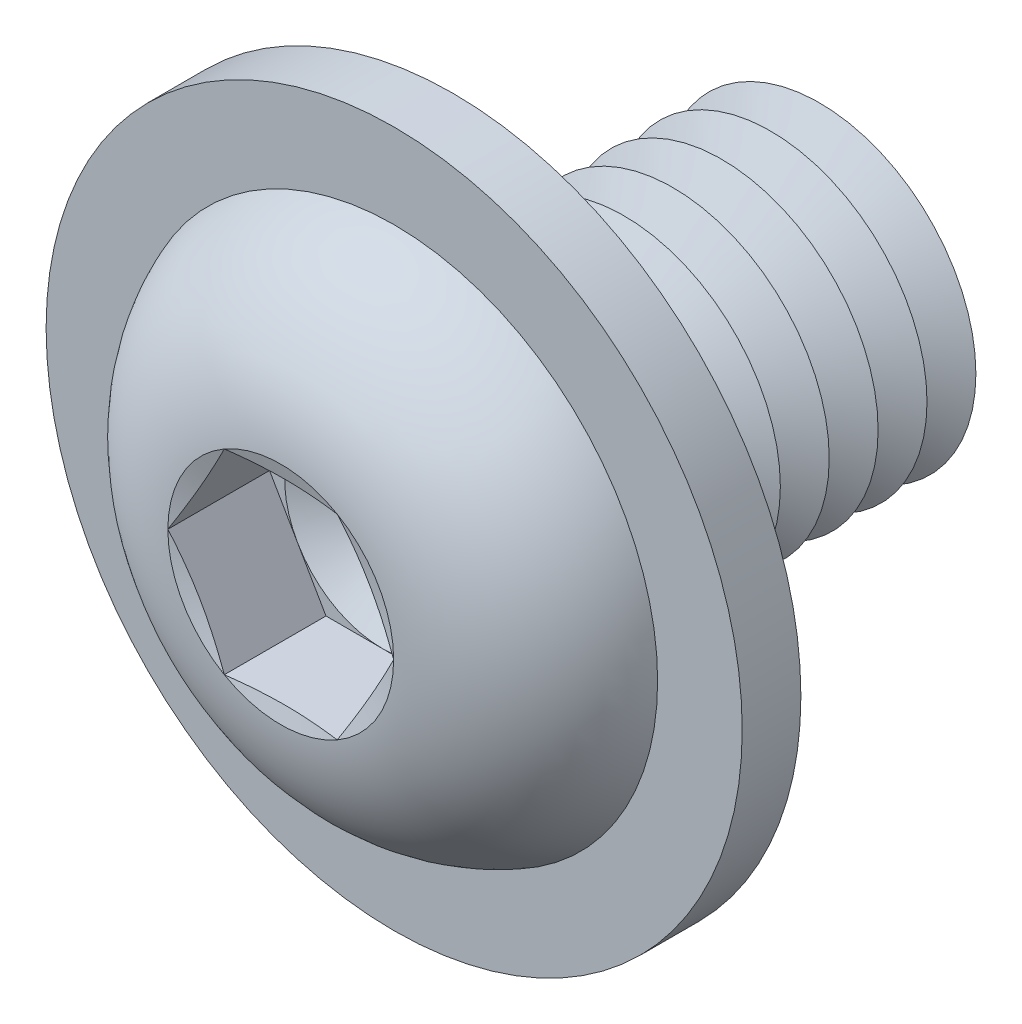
ISO-10303-21;
HEADER;
FILE_DESCRIPTION(('STEP AP214'),'2;1');
FILE_NAME('part.step','',(''),(''),'','','');
FILE_SCHEMA(('AUTOMOTIVE_DESIGN { 1 0 10303 214 1 1 1 1 }'));
ENDSEC;
DATA;
#1=APPLICATION_CONTEXT('core data for automotive mechanical design processes');
#2=APPLICATION_PROTOCOL_DEFINITION('international standard','automotive_design',2000,#1);
#3=PRODUCT_CONTEXT('',#1,'mechanical');
#4=PRODUCT('Part','Part','',(#3));
#5=PRODUCT_RELATED_PRODUCT_CATEGORY('part','',(#4));
#6=PRODUCT_DEFINITION_FORMATION('','',#4);
#7=PRODUCT_DEFINITION_CONTEXT('part definition',#1,'design');
#8=PRODUCT_DEFINITION('design','',#6,#7);
#9=PRODUCT_DEFINITION_SHAPE('','',#8);
#10=(LENGTH_UNIT() NAMED_UNIT(*) SI_UNIT(.MILLI.,.METRE.));
#11=(NAMED_UNIT(*) PLANE_ANGLE_UNIT() SI_UNIT($,.RADIAN.));
#12=(NAMED_UNIT(*) SI_UNIT($,.STERADIAN.) SOLID_ANGLE_UNIT());
#13=UNCERTAINTY_MEASURE_WITH_UNIT(LENGTH_MEASURE(1.E-05),#10,'distance_accuracy_value','');
#14=(GEOMETRIC_REPRESENTATION_CONTEXT(3) GLOBAL_UNCERTAINTY_ASSIGNED_CONTEXT((#13)) GLOBAL_UNIT_ASSIGNED_CONTEXT((#10,
#11,#12)) REPRESENTATION_CONTEXT('',''));
#15=CARTESIAN_POINT('',(0.,0.,0.));
#16=DIRECTION('',(0.,0.,1.));
#17=DIRECTION('',(1.,0.,0.));
#18=AXIS2_PLACEMENT_3D('',#15,#16,#17);
#19=CARTESIAN_POINT('',(0.,0.,-5.625));
#20=DIRECTION('',(0.,0.,1.));
#21=DIRECTION('',(1.,0.,0.));
#22=AXIS2_PLACEMENT_3D('',#19,#20,#21);
#23=CONICAL_SURFACE('',#22,4.,1.0471975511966);
#24=CARTESIAN_POINT('',(0.,0.,-6.25));
#25=DIRECTION('',(0.,0.,1.));
#26=DIRECTION('',(1.,0.,0.));
#27=AXIS2_PLACEMENT_3D('',#24,#25,#26);
#28=CIRCLE('',#27,2.91746824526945);
#29=CARTESIAN_POINT('',(2.91746824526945,0.,-6.25));
#30=VERTEX_POINT('',#29);
#31=EDGE_CURVE('E275',#30,#30,#28,.T.);
#32=ORIENTED_EDGE('',*,*,#31,.T.);
#33=EDGE_LOOP('',(#32));
#34=FACE_BOUND('',#33,.T.);
#35=CARTESIAN_POINT('',(0.,0.,-5.625));
#36=DIRECTION('',(0.,0.,1.));
#37=DIRECTION('',(1.,0.,0.));
#38=AXIS2_PLACEMENT_3D('',#35,#36,#37);
#39=CIRCLE('',#38,4.);
#40=CARTESIAN_POINT('',(4.,0.,-5.625));
#41=VERTEX_POINT('',#40);
#42=EDGE_CURVE('E271',#41,#41,#39,.T.);
#43=ORIENTED_EDGE('',*,*,#42,.F.);
#44=EDGE_LOOP('',(#43));
#45=FACE_BOUND('',#44,.T.);
#46=ADVANCED_FACE('F39',(#34,#45),#23,.T.);
#47=CARTESIAN_POINT('',(0.,0.,-6.25));
#48=DIRECTION('',(0.,0.,-1.));
#49=DIRECTION('',(-1.,0.,0.));
#50=AXIS2_PLACEMENT_3D('',#47,#48,#49);
#51=CONICAL_SURFACE('',#50,2.91746824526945,1.0471975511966);
#52=CARTESIAN_POINT('',(0.,0.,-6.875));
#53=DIRECTION('',(0.,0.,1.));
#54=DIRECTION('',(1.,0.,0.));
#55=AXIS2_PLACEMENT_3D('',#52,#53,#54);
#56=CIRCLE('',#55,4.);
#57=CARTESIAN_POINT('',(4.,0.,-6.875));
#58=VERTEX_POINT('',#57);
#59=EDGE_CURVE('E279',#58,#58,#56,.T.);
#60=ORIENTED_EDGE('',*,*,#59,.T.);
#61=EDGE_LOOP('',(#60));
#62=FACE_BOUND('',#61,.T.);
#63=ORIENTED_EDGE('',*,*,#31,.F.);
#64=EDGE_LOOP('',(#63));
#65=FACE_BOUND('',#64,.T.);
#66=ADVANCED_FACE('F390',(#62,#65),#51,.T.);
#67=CARTESIAN_POINT('',(0.,4.00000000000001,-10.));
#68=DIRECTION('',(0.,0.,-1.));
#69=DIRECTION('',(-1.,0.,0.));
#70=AXIS2_PLACEMENT_3D('',#67,#68,#69);
#71=PLANE('',#70);
#72=CARTESIAN_POINT('',(0.,0.,-10.));
#73=DIRECTION('',(0.,0.,1.));
#74=DIRECTION('',(1.,0.,0.));
#75=AXIS2_PLACEMENT_3D('',#72,#73,#74);
#76=CIRCLE('',#75,2.91746824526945);
#77=CARTESIAN_POINT('',(2.91746824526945,0.,-10.));
#78=VERTEX_POINT('',#77);
#79=EDGE_CURVE('E298',#78,#78,#76,.T.);
#80=ORIENTED_EDGE('',*,*,#79,.F.);
#81=EDGE_LOOP('',(#80));
#82=FACE_BOUND('',#81,.T.);
#83=ADVANCED_FACE('F396',(#82),#71,.T.);
#84=CARTESIAN_POINT('',(0.,0.,-9.375));
#85=DIRECTION('',(0.,0.,1.));
#86=DIRECTION('',(1.,0.,0.));
#87=AXIS2_PLACEMENT_3D('',#84,#85,#86);
#88=CONICAL_SURFACE('',#87,4.,1.0471975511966);
#89=ORIENTED_EDGE('',*,*,#79,.T.);
#90=EDGE_LOOP('',(#89));
#91=FACE_BOUND('',#90,.T.);
#92=CARTESIAN_POINT('',(0.,0.,-9.375));
#93=DIRECTION('',(0.,0.,1.));
#94=DIRECTION('',(1.,0.,0.));
#95=AXIS2_PLACEMENT_3D('',#92,#93,#94);
#96=CIRCLE('',#95,4.);
#97=CARTESIAN_POINT('',(4.,0.,-9.375));
#98=VERTEX_POINT('',#97);
#99=EDGE_CURVE('E294',#98,#98,#96,.T.);
#100=ORIENTED_EDGE('',*,*,#99,.F.);
#101=EDGE_LOOP('',(#100));
#102=FACE_BOUND('',#101,.T.);
#103=ADVANCED_FACE('F415',(#91,#102),#88,.T.);
#104=CARTESIAN_POINT('',(0.,0.,-8.75));
#105=DIRECTION('',(0.,0.,-1.));
#106=DIRECTION('',(-1.,0.,0.));
#107=AXIS2_PLACEMENT_3D('',#104,#105,#106);
#108=CONICAL_SURFACE('',#107,2.91746824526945,1.0471975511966);
#109=ORIENTED_EDGE('',*,*,#99,.T.);
#110=EDGE_LOOP('',(#109));
#111=FACE_BOUND('',#110,.T.);
#112=CARTESIAN_POINT('',(0.,0.,-8.75));
#113=DIRECTION('',(0.,0.,1.));
#114=DIRECTION('',(1.,0.,0.));
#115=AXIS2_PLACEMENT_3D('',#112,#113,#114);
#116=CIRCLE('',#115,2.91746824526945);
#117=CARTESIAN_POINT('',(2.91746824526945,0.,-8.75));
#118=VERTEX_POINT('',#117);
#119=EDGE_CURVE('E290',#118,#118,#116,.T.);
#120=ORIENTED_EDGE('',*,*,#119,.F.);
#121=EDGE_LOOP('',(#120));
#122=FACE_BOUND('',#121,.T.);
#123=ADVANCED_FACE('F412',(#111,#122),#108,.T.);
#124=CARTESIAN_POINT('',(0.,0.,-8.125));
#125=DIRECTION('',(0.,0.,1.));
#126=DIRECTION('',(1.,0.,0.));
#127=AXIS2_PLACEMENT_3D('',#124,#125,#126);
#128=CONICAL_SURFACE('',#127,4.,1.0471975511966);
#129=ORIENTED_EDGE('',*,*,#119,.T.);
#130=EDGE_LOOP('',(#129));
#131=FACE_BOUND('',#130,.T.);
#132=CARTESIAN_POINT('',(0.,0.,-8.125));
#133=DIRECTION('',(0.,0.,1.));
#134=DIRECTION('',(1.,0.,0.));
#135=AXIS2_PLACEMENT_3D('',#132,#133,#134);
#136=CIRCLE('',#135,4.);
#137=CARTESIAN_POINT('',(4.,0.,-8.125));
#138=VERTEX_POINT('',#137);
#139=EDGE_CURVE('E286',#138,#138,#136,.T.);
#140=ORIENTED_EDGE('',*,*,#139,.F.);
#141=EDGE_LOOP('',(#140));
#142=FACE_BOUND('',#141,.T.);
#143=ADVANCED_FACE('F406',(#131,#142),#128,.T.);
#144=CARTESIAN_POINT('',(0.,0.,-7.5));
#145=DIRECTION('',(0.,0.,-1.));
#146=DIRECTION('',(-1.,0.,0.));
#147=AXIS2_PLACEMENT_3D('',#144,#145,#146);
#148=CONICAL_SURFACE('',#147,2.91746824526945,1.0471975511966);
#149=ORIENTED_EDGE('',*,*,#139,.T.);
#150=EDGE_LOOP('',(#149));
#151=FACE_BOUND('',#150,.T.);
#152=CARTESIAN_POINT('',(0.,0.,-7.5));
#153=DIRECTION('',(0.,0.,1.));
#154=DIRECTION('',(1.,0.,0.));
#155=AXIS2_PLACEMENT_3D('',#152,#153,#154);
#156=CIRCLE('',#155,2.91746824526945);
#157=CARTESIAN_POINT('',(2.91746824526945,0.,-7.5));
#158=VERTEX_POINT('',#157);
#159=EDGE_CURVE('E283',#158,#158,#156,.T.);
#160=ORIENTED_EDGE('',*,*,#159,.F.);
#161=EDGE_LOOP('',(#160));
#162=FACE_BOUND('',#161,.T.);
#163=ADVANCED_FACE('F402',(#151,#162),#148,.T.);
#164=CARTESIAN_POINT('',(0.,0.,-6.875));
#165=DIRECTION('',(0.,0.,1.));
#166=DIRECTION('',(1.,0.,0.));
#167=AXIS2_PLACEMENT_3D('',#164,#165,#166);
#168=CONICAL_SURFACE('',#167,4.,1.0471975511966);
#169=ORIENTED_EDGE('',*,*,#159,.T.);
#170=EDGE_LOOP('',(#169));
#171=FACE_BOUND('',#170,.T.);
#172=ORIENTED_EDGE('',*,*,#59,.F.);
#173=EDGE_LOOP('',(#172));
#174=FACE_BOUND('',#173,.T.);
#175=ADVANCED_FACE('F405',(#171,#174),#168,.T.);
#176=CARTESIAN_POINT('',(0.,0.,-4.375));
#177=DIRECTION('',(0.,0.,1.));
#178=DIRECTION('',(1.,0.,0.));
#179=AXIS2_PLACEMENT_3D('',#176,#177,#178);
#180=CONICAL_SURFACE('',#179,4.,1.0471975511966);
#181=CARTESIAN_POINT('',(0.,0.,-5.));
#182=DIRECTION('',(0.,0.,1.));
#183=DIRECTION('',(1.,0.,0.));
#184=AXIS2_PLACEMENT_3D('',#181,#182,#183);
#185=CIRCLE('',#184,2.91746824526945);
#186=CARTESIAN_POINT('',(2.91746824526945,0.,-5.));
#187=VERTEX_POINT('',#186);
#188=EDGE_CURVE('E267',#187,#187,#185,.T.);
#189=ORIENTED_EDGE('',*,*,#188,.T.);
#190=EDGE_LOOP('',(#189));
#191=FACE_BOUND('',#190,.T.);
#192=CARTESIAN_POINT('',(0.,0.,-4.375));
#193=DIRECTION('',(0.,0.,1.));
#194=DIRECTION('',(1.,0.,0.));
#195=AXIS2_PLACEMENT_3D('',#192,#193,#194);
#196=CIRCLE('',#195,4.);
#197=CARTESIAN_POINT('',(4.,0.,-4.375));
#198=VERTEX_POINT('',#197);
#199=EDGE_CURVE('E263',#198,#198,#196,.T.);
#200=ORIENTED_EDGE('',*,*,#199,.F.);
#201=EDGE_LOOP('',(#200));
#202=FACE_BOUND('',#201,.T.);
#203=ADVANCED_FACE('F410',(#191,#202),#180,.T.);
#204=CARTESIAN_POINT('',(0.,0.,-5.));
#205=DIRECTION('',(0.,0.,-1.));
#206=DIRECTION('',(-1.,0.,0.));
#207=AXIS2_PLACEMENT_3D('',#204,#205,#206);
#208=CONICAL_SURFACE('',#207,2.91746824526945,1.0471975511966);
#209=ORIENTED_EDGE('',*,*,#42,.T.);
#210=EDGE_LOOP('',(#209));
#211=FACE_BOUND('',#210,.T.);
#212=ORIENTED_EDGE('',*,*,#188,.F.);
#213=EDGE_LOOP('',(#212));
#214=FACE_BOUND('',#213,.T.);
#215=ADVANCED_FACE('F461',(#211,#214),#208,.T.);
#216=CARTESIAN_POINT('',(0.,0.,-3.125));
#217=DIRECTION('',(0.,0.,1.));
#218=DIRECTION('',(1.,0.,0.));
#219=AXIS2_PLACEMENT_3D('',#216,#217,#218);
#220=CONICAL_SURFACE('',#219,4.,1.0471975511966);
#221=CARTESIAN_POINT('',(0.,0.,-3.75));
#222=DIRECTION('',(0.,0.,1.));
#223=DIRECTION('',(1.,0.,0.));
#224=AXIS2_PLACEMENT_3D('',#221,#222,#223);
#225=CIRCLE('',#224,2.91746824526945);
#226=CARTESIAN_POINT('',(2.91746824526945,0.,-3.75));
#227=VERTEX_POINT('',#226);
#228=EDGE_CURVE('E259',#227,#227,#225,.T.);
#229=ORIENTED_EDGE('',*,*,#228,.T.);
#230=EDGE_LOOP('',(#229));
#231=FACE_BOUND('',#230,.T.);
#232=CARTESIAN_POINT('',(0.,0.,-3.125));
#233=DIRECTION('',(0.,0.,1.));
#234=DIRECTION('',(1.,0.,0.));
#235=AXIS2_PLACEMENT_3D('',#232,#233,#234);
#236=CIRCLE('',#235,4.);
#237=CARTESIAN_POINT('',(4.,0.,-3.125));
#238=VERTEX_POINT('',#237);
#239=EDGE_CURVE('E255',#238,#238,#236,.T.);
#240=ORIENTED_EDGE('',*,*,#239,.F.);
#241=EDGE_LOOP('',(#240));
#242=FACE_BOUND('',#241,.T.);
#243=ADVANCED_FACE('F467',(#231,#242),#220,.T.);
#244=CARTESIAN_POINT('',(0.,0.,-3.75));
#245=DIRECTION('',(0.,0.,-1.));
#246=DIRECTION('',(-1.,0.,0.));
#247=AXIS2_PLACEMENT_3D('',#244,#245,#246);
#248=CONICAL_SURFACE('',#247,2.91746824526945,1.0471975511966);
#249=ORIENTED_EDGE('',*,*,#199,.T.);
#250=EDGE_LOOP('',(#249));
#251=FACE_BOUND('',#250,.T.);
#252=ORIENTED_EDGE('',*,*,#228,.F.);
#253=EDGE_LOOP('',(#252));
#254=FACE_BOUND('',#253,.T.);
#255=ADVANCED_FACE('F474',(#251,#254),#248,.T.);
#256=CARTESIAN_POINT('',(0.,0.,-1.875));
#257=DIRECTION('',(0.,0.,1.));
#258=DIRECTION('',(1.,0.,0.));
#259=AXIS2_PLACEMENT_3D('',#256,#257,#258);
#260=CONICAL_SURFACE('',#259,4.,1.0471975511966);
#261=CARTESIAN_POINT('',(0.,0.,-2.5));
#262=DIRECTION('',(0.,0.,1.));
#263=DIRECTION('',(1.,0.,0.));
#264=AXIS2_PLACEMENT_3D('',#261,#262,#263);
#265=CIRCLE('',#264,2.91746824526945);
#266=CARTESIAN_POINT('',(2.91746824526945,0.,-2.5));
#267=VERTEX_POINT('',#266);
#268=EDGE_CURVE('E251',#267,#267,#265,.T.);
#269=ORIENTED_EDGE('',*,*,#268,.T.);
#270=EDGE_LOOP('',(#269));
#271=FACE_BOUND('',#270,.T.);
#272=CARTESIAN_POINT('',(0.,0.,-1.875));
#273=DIRECTION('',(0.,0.,1.));
#274=DIRECTION('',(1.,0.,0.));
#275=AXIS2_PLACEMENT_3D('',#272,#273,#274);
#276=CIRCLE('',#275,4.);
#277=CARTESIAN_POINT('',(4.,0.,-1.875));
#278=VERTEX_POINT('',#277);
#279=EDGE_CURVE('E243',#278,#278,#276,.T.);
#280=ORIENTED_EDGE('',*,*,#279,.F.);
#281=EDGE_LOOP('',(#280));
#282=FACE_BOUND('',#281,.T.);
#283=ADVANCED_FACE('F481',(#271,#282),#260,.T.);
#284=CARTESIAN_POINT('',(0.,0.,-2.5));
#285=DIRECTION('',(0.,0.,-1.));
#286=DIRECTION('',(-1.,0.,0.));
#287=AXIS2_PLACEMENT_3D('',#284,#285,#286);
#288=CONICAL_SURFACE('',#287,2.91746824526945,1.0471975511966);
#289=ORIENTED_EDGE('',*,*,#239,.T.);
#290=EDGE_LOOP('',(#289));
#291=FACE_BOUND('',#290,.T.);
#292=ORIENTED_EDGE('',*,*,#268,.F.);
#293=EDGE_LOOP('',(#292));
#294=FACE_BOUND('',#293,.T.);
#295=ADVANCED_FACE('F488',(#291,#294),#288,.T.);
#296=CARTESIAN_POINT('',(0.,0.,-0.624999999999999));
#297=DIRECTION('',(0.,0.,1.));
#298=DIRECTION('',(1.,0.,0.));
#299=AXIS2_PLACEMENT_3D('',#296,#297,#298);
#300=CONICAL_SURFACE('',#299,4.,1.0471975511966);
#301=CARTESIAN_POINT('',(0.,0.,-1.25));
#302=DIRECTION('',(0.,0.,1.));
#303=DIRECTION('',(1.,0.,0.));
#304=AXIS2_PLACEMENT_3D('',#301,#302,#303);
#305=CIRCLE('',#304,2.91746824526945);
#306=CARTESIAN_POINT('',(2.91746824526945,0.,-1.25));
#307=VERTEX_POINT('',#306);
#308=EDGE_CURVE('E232',#307,#307,#305,.T.);
#309=ORIENTED_EDGE('',*,*,#308,.T.);
#310=EDGE_LOOP('',(#309));
#311=FACE_BOUND('',#310,.T.);
#312=CARTESIAN_POINT('',(0.,0.,-0.624999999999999));
#313=DIRECTION('',(0.,0.,1.));
#314=DIRECTION('',(1.,0.,0.));
#315=AXIS2_PLACEMENT_3D('',#312,#313,#314);
#316=CIRCLE('',#315,4.);
#317=CARTESIAN_POINT('',(4.,0.,-0.624999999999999));
#318=VERTEX_POINT('',#317);
#319=EDGE_CURVE('E247',#318,#318,#316,.T.);
#320=ORIENTED_EDGE('',*,*,#319,.F.);
#321=EDGE_LOOP('',(#320));
#322=FACE_BOUND('',#321,.T.);
#323=ADVANCED_FACE('F495',(#311,#322),#300,.T.);
#324=CARTESIAN_POINT('',(0.,0.,-1.25));
#325=DIRECTION('',(0.,0.,-1.));
#326=DIRECTION('',(-1.,0.,0.));
#327=AXIS2_PLACEMENT_3D('',#324,#325,#326);
#328=CONICAL_SURFACE('',#327,2.91746824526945,1.0471975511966);
#329=ORIENTED_EDGE('',*,*,#279,.T.);
#330=EDGE_LOOP('',(#329));
#331=FACE_BOUND('',#330,.T.);
#332=ORIENTED_EDGE('',*,*,#308,.F.);
#333=EDGE_LOOP('',(#332));
#334=FACE_BOUND('',#333,.T.);
#335=ADVANCED_FACE('F221',(#331,#334),#328,.T.);
#336=CARTESIAN_POINT('',(0.,4.,0.));
#337=DIRECTION('',(0.,0.,-1.));
#338=DIRECTION('',(-1.,0.,0.));
#339=AXIS2_PLACEMENT_3D('',#336,#337,#338);
#340=PLANE('',#339);
#341=CARTESIAN_POINT('',(0.,0.,0.));
#342=DIRECTION('',(0.,0.,-1.));
#343=DIRECTION('',(-1.,0.,0.));
#344=AXIS2_PLACEMENT_3D('',#341,#342,#343);
#345=CIRCLE('',#344,4.625);
#346=CARTESIAN_POINT('',(-4.625,0.,0.));
#347=VERTEX_POINT('',#346);
#348=EDGE_CURVE('E307',#347,#347,#345,.F.);
#349=ORIENTED_EDGE('',*,*,#348,.T.);
#350=EDGE_LOOP('',(#349));
#351=FACE_BOUND('',#350,.T.);
#352=CARTESIAN_POINT('',(0.,0.,0.));
#353=DIRECTION('',(0.,0.,-1.));
#354=DIRECTION('',(0.,1.,0.));
#355=AXIS2_PLACEMENT_3D('',#352,#353,#354);
#356=CIRCLE('',#355,8.9);
#357=CARTESIAN_POINT('',(0.,8.9,0.));
#358=VERTEX_POINT('',#357);
#359=EDGE_CURVE('E367',#358,#358,#356,.T.);
#360=ORIENTED_EDGE('',*,*,#359,.T.);
#361=EDGE_LOOP('',(#360));
#362=FACE_BOUND('',#361,.T.);
#363=ADVANCED_FACE('F377',(#351,#362),#340,.T.);
#364=CARTESIAN_POINT('',(0.,0.,-0.624999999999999));
#365=DIRECTION('',(0.,0.,-1.));
#366=DIRECTION('',(-1.,0.,0.));
#367=AXIS2_PLACEMENT_3D('',#364,#365,#366);
#368=TOROIDAL_SURFACE('',#367,4.625,0.625);
#369=ORIENTED_EDGE('',*,*,#348,.F.);
#370=EDGE_LOOP('',(#369));
#371=FACE_BOUND('',#370,.T.);
#372=ORIENTED_EDGE('',*,*,#319,.T.);
#373=EDGE_LOOP('',(#372));
#374=FACE_BOUND('',#373,.T.);
#375=ADVANCED_FACE('F41',(#371,#374),#368,.F.);
#376=CARTESIAN_POINT('',(0.,0.,1.5));
#377=DIRECTION('',(0.,0.,-1.));
#378=DIRECTION('',(0.,1.,0.));
#379=AXIS2_PLACEMENT_3D('',#376,#377,#378);
#380=CYLINDRICAL_SURFACE('',#379,8.9);
#381=CARTESIAN_POINT('',(0.,0.,1.5));
#382=DIRECTION('',(0.,0.,-1.));
#383=DIRECTION('',(0.,1.,0.));
#384=AXIS2_PLACEMENT_3D('',#381,#382,#383);
#385=CIRCLE('',#384,8.9);
#386=CARTESIAN_POINT('',(0.,8.9,1.5));
#387=VERTEX_POINT('',#386);
#388=EDGE_CURVE('E365',#387,#387,#385,.T.);
#389=ORIENTED_EDGE('',*,*,#388,.T.);
#390=EDGE_LOOP('',(#389));
#391=FACE_BOUND('',#390,.T.);
#392=ORIENTED_EDGE('',*,*,#359,.F.);
#393=EDGE_LOOP('',(#392));
#394=FACE_BOUND('',#393,.T.);
#395=ADVANCED_FACE('F379',(#391,#394),#380,.T.);
#396=CARTESIAN_POINT('',(0.,0.,1.5));
#397=DIRECTION('',(0.,0.,-1.));
#398=DIRECTION('',(0.,1.,0.));
#399=AXIS2_PLACEMENT_3D('',#396,#397,#398);
#400=PLANE('',#399);
#401=CARTESIAN_POINT('',(0.,0.,1.5));
#402=DIRECTION('',(0.,0.,-1.));
#403=DIRECTION('',(0.,1.,0.));
#404=AXIS2_PLACEMENT_3D('',#401,#402,#403);
#405=CIRCLE('',#404,6.73705889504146);
#406=CARTESIAN_POINT('',(0.,6.73705889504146,1.5));
#407=VERTEX_POINT('',#406);
#408=EDGE_CURVE('E43',#407,#407,#405,.F.);
#409=ORIENTED_EDGE('',*,*,#408,.F.);
#410=EDGE_LOOP('',(#409));
#411=FACE_BOUND('',#410,.T.);
#412=ORIENTED_EDGE('',*,*,#388,.F.);
#413=EDGE_LOOP('',(#412));
#414=FACE_BOUND('',#413,.T.);
#415=ADVANCED_FACE('F117',(#411,#414),#400,.F.);
#416=CARTESIAN_POINT('',(0.,0.,1.8));
#417=DIRECTION('',(0.,0.,1.));
#418=DIRECTION('',(1.,0.,0.));
#419=AXIS2_PLACEMENT_3D('',#416,#417,#418);
#420=CONICAL_SURFACE('',#419,2.49999883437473,1.0471975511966);
#421=CARTESIAN_POINT('',(0.,0.,0.35662500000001));
#422=VERTEX_POINT('',#421);
#423=VERTEX_LOOP('',#422);
#424=FACE_BOUND('',#423,.T.);
#425=CARTESIAN_POINT('',(0.,0.,1.8));
#426=DIRECTION('',(0.,0.,1.));
#427=DIRECTION('',(1.,0.,0.));
#428=AXIS2_PLACEMENT_3D('',#425,#426,#427);
#429=CIRCLE('',#428,2.49999883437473);
#430=CARTESIAN_POINT('',(2.1650625,1.24999941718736,1.8));
#431=VERTEX_POINT('',#430);
#432=CARTESIAN_POINT('',(0.,2.49999883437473,1.8));
#433=VERTEX_POINT('',#432);
#434=EDGE_CURVE('E120',#431,#433,#429,.T.);
#435=ORIENTED_EDGE('',*,*,#434,.T.);
#436=CARTESIAN_POINT('',(0.,0.,1.8));
#437=DIRECTION('',(0.,0.,1.));
#438=DIRECTION('',(1.,0.,0.));
#439=AXIS2_PLACEMENT_3D('',#436,#437,#438);
#440=CIRCLE('',#439,2.49999883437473);
#441=CARTESIAN_POINT('',(-2.1650625,1.24999941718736,1.8));
#442=VERTEX_POINT('',#441);
#443=EDGE_CURVE('E11',#433,#442,#440,.T.);
#444=ORIENTED_EDGE('',*,*,#443,.T.);
#445=CARTESIAN_POINT('',(-2.1650625,-1.24999941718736,1.8));
#446=VERTEX_POINT('',#445);
#447=EDGE_CURVE('E49',#442,#446,#440,.T.);
#448=ORIENTED_EDGE('',*,*,#447,.T.);
#449=CARTESIAN_POINT('',(0.,-2.49999883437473,1.8));
#450=VERTEX_POINT('',#449);
#451=EDGE_CURVE('E313',#446,#450,#440,.T.);
#452=ORIENTED_EDGE('',*,*,#451,.T.);
#453=CARTESIAN_POINT('',(2.1650625,-1.24999941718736,1.8));
#454=VERTEX_POINT('',#453);
#455=EDGE_CURVE('E57',#450,#454,#440,.T.);
#456=ORIENTED_EDGE('',*,*,#455,.T.);
#457=EDGE_CURVE('E50',#454,#431,#440,.T.);
#458=ORIENTED_EDGE('',*,*,#457,.T.);
#459=EDGE_LOOP('',(#435,#444,#448,#452,#456,#458));
#460=FACE_BOUND('',#459,.T.);
#461=ADVANCED_FACE('F114',(#424,#460),#420,.F.);
#462=CARTESIAN_POINT('',(0.,0.,1.8));
#463=DIRECTION('',(0.,0.,1.));
#464=DIRECTION('',(1.,0.,0.));
#465=AXIS2_PLACEMENT_3D('',#462,#463,#464);
#466=PLANE('',#465);
#467=ORIENTED_EDGE('',*,*,#451,.F.);
#468=DIRECTION('',(0.5,-0.866025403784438,0.));
#469=VECTOR('',#468,1.);
#470=CARTESIAN_POINT('',(-2.88675,0.,1.8));
#471=LINE('',#470,#469);
#472=CARTESIAN_POINT('',(-1.443375,-2.49999883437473,1.8));
#473=VERTEX_POINT('',#472);
#474=EDGE_CURVE('E154',#446,#473,#471,.T.);
#475=ORIENTED_EDGE('',*,*,#474,.T.);
#476=DIRECTION('',(1.,0.,0.));
#477=VECTOR('',#476,1.);
#478=CARTESIAN_POINT('',(-1.443375,-2.49999883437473,1.8));
#479=LINE('',#478,#477);
#480=EDGE_CURVE('E160',#473,#450,#479,.T.);
#481=ORIENTED_EDGE('',*,*,#480,.T.);
#482=EDGE_LOOP('',(#467,#475,#481));
#483=FACE_BOUND('',#482,.T.);
#484=ADVANCED_FACE('F116',(#483),#466,.T.);
#485=ORIENTED_EDGE('',*,*,#455,.F.);
#486=CARTESIAN_POINT('',(1.443375,-2.49999883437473,1.8));
#487=VERTEX_POINT('',#486);
#488=EDGE_CURVE('E159',#450,#487,#479,.T.);
#489=ORIENTED_EDGE('',*,*,#488,.T.);
#490=DIRECTION('',(0.5,0.866025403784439,0.));
#491=VECTOR('',#490,1.);
#492=CARTESIAN_POINT('',(1.443375,-2.49999883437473,1.8));
#493=LINE('',#492,#491);
#494=EDGE_CURVE('E165',#487,#454,#493,.T.);
#495=ORIENTED_EDGE('',*,*,#494,.T.);
#496=EDGE_LOOP('',(#485,#489,#495));
#497=FACE_BOUND('',#496,.T.);
#498=ADVANCED_FACE('F537',(#497),#466,.T.);
#499=ORIENTED_EDGE('',*,*,#457,.F.);
#500=CARTESIAN_POINT('',(2.88675,0.,1.8));
#501=VERTEX_POINT('',#500);
#502=EDGE_CURVE('E164',#454,#501,#493,.T.);
#503=ORIENTED_EDGE('',*,*,#502,.T.);
#504=DIRECTION('',(-0.5,0.866025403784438,0.));
#505=VECTOR('',#504,1.);
#506=CARTESIAN_POINT('',(2.88675,0.,1.8));
#507=LINE('',#506,#505);
#508=EDGE_CURVE('E142',#501,#431,#507,.T.);
#509=ORIENTED_EDGE('',*,*,#508,.T.);
#510=EDGE_LOOP('',(#499,#503,#509));
#511=FACE_BOUND('',#510,.T.);
#512=ADVANCED_FACE('F546',(#511),#466,.T.);
#513=ORIENTED_EDGE('',*,*,#434,.F.);
#514=CARTESIAN_POINT('',(1.443375,2.49999883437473,1.8));
#515=VERTEX_POINT('',#514);
#516=EDGE_CURVE('E127',#431,#515,#507,.T.);
#517=ORIENTED_EDGE('',*,*,#516,.T.);
#518=DIRECTION('',(-1.,0.,0.));
#519=VECTOR('',#518,1.);
#520=CARTESIAN_POINT('',(1.443375,2.49999883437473,1.8));
#521=LINE('',#520,#519);
#522=EDGE_CURVE('E138',#515,#433,#521,.T.);
#523=ORIENTED_EDGE('',*,*,#522,.T.);
#524=EDGE_LOOP('',(#513,#517,#523));
#525=FACE_BOUND('',#524,.T.);
#526=ADVANCED_FACE('F144',(#525),#466,.T.);
#527=ORIENTED_EDGE('',*,*,#443,.F.);
#528=CARTESIAN_POINT('',(-1.443375,2.49999883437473,1.8));
#529=VERTEX_POINT('',#528);
#530=EDGE_CURVE('E133',#433,#529,#521,.T.);
#531=ORIENTED_EDGE('',*,*,#530,.T.);
#532=DIRECTION('',(-0.5,-0.866025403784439,0.));
#533=VECTOR('',#532,1.);
#534=CARTESIAN_POINT('',(-1.443375,2.49999883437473,1.8));
#535=LINE('',#534,#533);
#536=EDGE_CURVE('E136',#529,#442,#535,.T.);
#537=ORIENTED_EDGE('',*,*,#536,.T.);
#538=EDGE_LOOP('',(#527,#531,#537));
#539=FACE_BOUND('',#538,.T.);
#540=ADVANCED_FACE('F132',(#539),#466,.T.);
#541=ORIENTED_EDGE('',*,*,#447,.F.);
#542=CARTESIAN_POINT('',(-2.88675,0.,1.8));
#543=VERTEX_POINT('',#542);
#544=EDGE_CURVE('E146',#442,#543,#535,.T.);
#545=ORIENTED_EDGE('',*,*,#544,.T.);
#546=EDGE_CURVE('E155',#543,#446,#471,.T.);
#547=ORIENTED_EDGE('',*,*,#546,.T.);
#548=EDGE_LOOP('',(#541,#545,#547));
#549=FACE_BOUND('',#548,.T.);
#550=ADVANCED_FACE('F328',(#549),#466,.T.);
#551=CARTESIAN_POINT('',(-2.88675,0.,1.8));
#552=DIRECTION('',(-0.866025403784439,-0.5,0.));
#553=DIRECTION('',(0.5,-0.866025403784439,0.));
#554=AXIS2_PLACEMENT_3D('',#551,#552,#553);
#555=PLANE('',#554);
#556=CARTESIAN_POINT('',(-2.88686547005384,0.000200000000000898,4.40003094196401));
#557=CARTESIAN_POINT('',(-2.82691617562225,-0.103635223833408,4.3839595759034));
#558=CARTESIAN_POINT('',(-2.76685817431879,-0.207658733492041,4.36936933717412));
#559=CARTESIAN_POINT('',(-2.64653003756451,-0.416073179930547,4.3437355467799));
#560=CARTESIAN_POINT('',(-2.58625982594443,-0.520464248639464,4.33269343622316));
#561=CARTESIAN_POINT('',(-2.46587274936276,-0.728980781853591,4.31480063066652));
#562=CARTESIAN_POINT('',(-2.40575669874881,-0.833104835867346,4.3079285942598));
#563=CARTESIAN_POINT('',(-2.28544792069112,-1.0414857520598,4.29871388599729));
#564=CARTESIAN_POINT('',(-2.22525521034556,-1.14574258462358,4.29637033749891));
#565=CARTESIAN_POINT('',(-2.10486978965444,-1.35425624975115,4.29637033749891));
#566=CARTESIAN_POINT('',(-2.04467707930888,-1.45851308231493,4.29871388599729));
#567=CARTESIAN_POINT('',(-1.92436830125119,-1.66689399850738,4.3079285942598));
#568=CARTESIAN_POINT('',(-1.86425225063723,-1.77101805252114,4.31480063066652));
#569=CARTESIAN_POINT('',(-1.74386517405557,-1.97953458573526,4.33269343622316));
#570=CARTESIAN_POINT('',(-1.68359496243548,-2.08392565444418,4.3437355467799));
#571=CARTESIAN_POINT('',(-1.56326682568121,-2.29234010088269,4.36936933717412));
#572=CARTESIAN_POINT('',(-1.50320882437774,-2.39636361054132,4.3839595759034));
#573=CARTESIAN_POINT('',(-1.44325952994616,-2.50019883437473,4.40003094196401));
#574=B_SPLINE_CURVE_WITH_KNOTS('',3,(#556,#557,#558,#559,#560,#561,#562,#563,#564,#565,#566,
#567,#568,#569,#570,#571,#572,#573),.UNSPECIFIED.,.F.,.F.,(4,2,2,2,2,2,2,2,4),(0.,
0.362931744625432,0.726010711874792,1.08721550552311,1.44835036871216,1.8094852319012,
2.17069002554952,2.53376899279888,2.89670073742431),.UNSPECIFIED.);
#575=CARTESIAN_POINT('',(-2.88675,0.,4.4));
#576=VERTEX_POINT('',#575);
#577=CARTESIAN_POINT('',(-1.443375,-2.49999883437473,4.4));
#578=VERTEX_POINT('',#577);
#579=EDGE_CURVE('E333',#576,#578,#574,.T.);
#580=ORIENTED_EDGE('',*,*,#579,.T.);
#581=DIRECTION('',(0.,0.,1.));
#582=VECTOR('',#581,1.);
#583=CARTESIAN_POINT('',(-1.443375,-2.49999883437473,1.8));
#584=LINE('',#583,#582);
#585=EDGE_CURVE('E178',#473,#578,#584,.T.);
#586=ORIENTED_EDGE('',*,*,#585,.F.);
#587=ORIENTED_EDGE('',*,*,#474,.F.);
#588=ORIENTED_EDGE('',*,*,#546,.F.);
#589=DIRECTION('',(0.,0.,1.));
#590=VECTOR('',#589,1.);
#591=CARTESIAN_POINT('',(-2.88675,0.,1.8));
#592=LINE('',#591,#590);
#593=EDGE_CURVE('E182',#543,#576,#592,.T.);
#594=ORIENTED_EDGE('',*,*,#593,.T.);
#595=EDGE_LOOP('',(#580,#586,#587,#588,#594));
#596=FACE_BOUND('',#595,.T.);
#597=ADVANCED_FACE('F326',(#596),#555,.F.);
#598=CARTESIAN_POINT('',(-1.443375,-2.49999883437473,1.8));
#599=DIRECTION('',(0.,-1.,0.));
#600=DIRECTION('',(1.,0.,0.));
#601=AXIS2_PLACEMENT_3D('',#598,#599,#600);
#602=PLANE('',#601);
#603=CARTESIAN_POINT('',(-4.35611719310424,-2.49999883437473,4.97227902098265));
#604=CARTESIAN_POINT('',(-4.25066509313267,-2.49999883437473,4.94777440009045));
#605=CARTESIAN_POINT('',(-4.14516541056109,-2.49999883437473,4.92347459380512));
#606=CARTESIAN_POINT('',(-3.93405094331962,-2.49999883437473,4.87537247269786));
#607=CARTESIAN_POINT('',(-3.82843615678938,-2.49999883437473,4.85157016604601));
#608=CARTESIAN_POINT('',(-3.5113534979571,-2.49999883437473,4.78103338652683));
#609=CARTESIAN_POINT('',(-3.29968815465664,-2.49999883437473,4.73517861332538));
#610=CARTESIAN_POINT('',(-2.87365524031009,-2.49999883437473,4.6464558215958));
#611=CARTESIAN_POINT('',(-2.65928093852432,-2.49999883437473,4.60361983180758));
#612=CARTESIAN_POINT('',(-2.22952626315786,-2.49999883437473,4.52311285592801));
#613=CARTESIAN_POINT('',(-2.01414580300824,-2.49999883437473,4.48544232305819));
#614=CARTESIAN_POINT('',(-1.58798319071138,-2.49999883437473,4.41876559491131));
#615=CARTESIAN_POINT('',(-1.37723418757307,-2.49999883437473,4.38955265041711));
#616=CARTESIAN_POINT('',(-0.954530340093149,-2.49999883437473,4.34171384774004));
#617=CARTESIAN_POINT('',(-0.742575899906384,-2.49999883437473,4.32308463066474));
#618=CARTESIAN_POINT('',(-0.424544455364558,-2.49999883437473,4.30539140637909));
#619=CARTESIAN_POINT('',(-0.318745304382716,-2.49999883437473,4.30120018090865));
#620=CARTESIAN_POINT('',(-0.107062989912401,-2.49999883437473,4.29638997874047));
#621=CARTESIAN_POINT('',(-0.00117982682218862,-2.49999883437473,4.29577098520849));
#622=CARTESIAN_POINT('',(0.210552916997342,-2.49999883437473,4.29814378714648));
#623=CARTESIAN_POINT('',(0.316402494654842,-2.49999883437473,4.30113585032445));
#624=CARTESIAN_POINT('',(0.527944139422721,-2.49999883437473,4.31057322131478));
#625=CARTESIAN_POINT('',(0.633636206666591,-2.49999883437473,4.31701852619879));
#626=CARTESIAN_POINT('',(0.890304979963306,-2.49999883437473,4.33652018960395));
#627=CARTESIAN_POINT('',(1.0411561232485,-2.49999883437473,4.35122885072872));
#628=CARTESIAN_POINT('',(1.34222474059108,-2.49999883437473,4.38593609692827));
#629=CARTESIAN_POINT('',(1.49244223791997,-2.49999883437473,4.40593448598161));
#630=CARTESIAN_POINT('',(1.79273634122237,-2.49999883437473,4.45011321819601));
#631=CARTESIAN_POINT('',(1.94281100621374,-2.49999883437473,4.47430656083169));
#632=CARTESIAN_POINT('',(2.24242097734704,-2.49999883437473,4.52583552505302));
#633=CARTESIAN_POINT('',(2.39195625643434,-2.49999883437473,4.55317130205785));
#634=CARTESIAN_POINT('',(2.69364402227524,-2.49999883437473,4.61079781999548));
#635=CARTESIAN_POINT('',(2.8457870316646,-2.49999883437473,4.64113779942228));
#636=CARTESIAN_POINT('',(3.14969016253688,-2.49999883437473,4.70367638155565));
#637=CARTESIAN_POINT('',(3.30145027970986,-2.49999883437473,4.73587500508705));
#638=CARTESIAN_POINT('',(3.60383766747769,-2.49999883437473,4.80150275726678));
#639=CARTESIAN_POINT('',(3.75446660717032,-2.49999883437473,4.83492423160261));
#640=CARTESIAN_POINT('',(4.05546753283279,-2.49999883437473,4.90285814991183));
#641=CARTESIAN_POINT('',(4.2058395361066,-2.49999883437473,4.93737051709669));
#642=CARTESIAN_POINT('',(4.35611719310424,-2.49999883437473,4.97227902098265));
#643=B_SPLINE_CURVE_WITH_KNOTS('',3,(#603,#604,#605,#606,#607,#608,#609,#610,#611,#612,#613,
#614,#615,#616,#617,#618,#619,#620,#621,#622,#623,#624,#625,#626,#627,#628,#629,#630,#631,#632,
#633,#634,#635,#636,#637,#638,#639,#640,#641,#642),.UNSPECIFIED.,.F.,.F.,(4,2,2,2,2,2,2,2,2,2,2,
2,2,2,2,2,2,2,2,4),(0.,0.324785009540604,0.6495753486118,1.29928181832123,1.95507889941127,
2.61093348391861,3.24905289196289,3.88696967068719,4.204563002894,4.5221548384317,
4.83977022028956,5.15738533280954,5.61196030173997,6.06651842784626,6.52251118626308,
6.97852650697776,7.44392737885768,7.90933346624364,8.37220553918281,8.83504510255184),.UNSPECIFIED.);
#644=CARTESIAN_POINT('',(1.443375,-2.49999883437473,4.4));
#645=VERTEX_POINT('',#644);
#646=EDGE_CURVE('E339',#578,#645,#643,.T.);
#647=ORIENTED_EDGE('',*,*,#646,.T.);
#648=DIRECTION('',(0.,0.,1.));
#649=VECTOR('',#648,1.);
#650=CARTESIAN_POINT('',(1.443375,-2.49999883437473,1.8));
#651=LINE('',#650,#649);
#652=EDGE_CURVE('E174',#487,#645,#651,.T.);
#653=ORIENTED_EDGE('',*,*,#652,.F.);
#654=ORIENTED_EDGE('',*,*,#488,.F.);
#655=ORIENTED_EDGE('',*,*,#480,.F.);
#656=ORIENTED_EDGE('',*,*,#585,.T.);
#657=EDGE_LOOP('',(#647,#653,#654,#655,#656));
#658=FACE_BOUND('',#657,.T.);
#659=ADVANCED_FACE('F580',(#658),#602,.F.);
#660=CARTESIAN_POINT('',(1.443375,-2.49999883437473,1.8));
#661=DIRECTION('',(0.866025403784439,-0.5,0.));
#662=DIRECTION('',(0.5,0.866025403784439,0.));
#663=AXIS2_PLACEMENT_3D('',#660,#661,#662);
#664=PLANE('',#663);
#665=CARTESIAN_POINT('',(1.44325952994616,-2.50019883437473,4.40003094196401));
#666=CARTESIAN_POINT('',(1.50320882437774,-2.39636361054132,4.3839595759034));
#667=CARTESIAN_POINT('',(1.56326682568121,-2.29234010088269,4.36936933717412));
#668=CARTESIAN_POINT('',(1.68359496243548,-2.08392565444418,4.3437355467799));
#669=CARTESIAN_POINT('',(1.74386517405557,-1.97953458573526,4.33269343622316));
#670=CARTESIAN_POINT('',(1.86425225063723,-1.77101805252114,4.31480063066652));
#671=CARTESIAN_POINT('',(1.92436830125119,-1.66689399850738,4.3079285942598));
#672=CARTESIAN_POINT('',(2.04467707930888,-1.45851308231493,4.29871388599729));
#673=CARTESIAN_POINT('',(2.10486978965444,-1.35425624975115,4.29637033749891));
#674=CARTESIAN_POINT('',(2.22525521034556,-1.14574258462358,4.29637033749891));
#675=CARTESIAN_POINT('',(2.28544792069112,-1.0414857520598,4.29871388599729));
#676=CARTESIAN_POINT('',(2.40575669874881,-0.833104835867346,4.3079285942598));
#677=CARTESIAN_POINT('',(2.46587274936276,-0.728980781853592,4.31480063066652));
#678=CARTESIAN_POINT('',(2.58625982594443,-0.520464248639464,4.33269343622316));
#679=CARTESIAN_POINT('',(2.64653003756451,-0.416073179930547,4.3437355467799));
#680=CARTESIAN_POINT('',(2.76685817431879,-0.207658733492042,4.36936933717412));
#681=CARTESIAN_POINT('',(2.82691617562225,-0.103635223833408,4.3839595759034));
#682=CARTESIAN_POINT('',(2.88686547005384,0.00020000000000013,4.40003094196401));
#683=B_SPLINE_CURVE_WITH_KNOTS('',3,(#665,#666,#667,#668,#669,#670,#671,#672,#673,#674,#675,
#676,#677,#678,#679,#680,#681,#682),.UNSPECIFIED.,.F.,.F.,(4,2,2,2,2,2,2,2,4),(0.,
0.362931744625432,0.726010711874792,1.08721550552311,1.44835036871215,1.80948523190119,
2.17069002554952,2.53376899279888,2.89670073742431),.UNSPECIFIED.);
#684=CARTESIAN_POINT('',(2.88675,0.,4.4));
#685=VERTEX_POINT('',#684);
#686=EDGE_CURVE('E233',#645,#685,#683,.T.);
#687=ORIENTED_EDGE('',*,*,#686,.T.);
#688=DIRECTION('',(0.,0.,1.));
#689=VECTOR('',#688,1.);
#690=CARTESIAN_POINT('',(2.88675,0.,1.8));
#691=LINE('',#690,#689);
#692=EDGE_CURVE('E169',#501,#685,#691,.T.);
#693=ORIENTED_EDGE('',*,*,#692,.F.);
#694=ORIENTED_EDGE('',*,*,#502,.F.);
#695=ORIENTED_EDGE('',*,*,#494,.F.);
#696=ORIENTED_EDGE('',*,*,#652,.T.);
#697=EDGE_LOOP('',(#687,#693,#694,#695,#696));
#698=FACE_BOUND('',#697,.T.);
#699=ADVANCED_FACE('F219',(#698),#664,.F.);
#700=CARTESIAN_POINT('',(2.88675,0.,1.8));
#701=DIRECTION('',(0.866025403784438,0.5,0.));
#702=DIRECTION('',(-0.5,0.866025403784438,0.));
#703=AXIS2_PLACEMENT_3D('',#700,#701,#702);
#704=PLANE('',#703);
#705=CARTESIAN_POINT('',(2.88686547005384,-0.000199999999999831,4.40003094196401));
#706=CARTESIAN_POINT('',(2.82691617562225,0.103635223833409,4.3839595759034));
#707=CARTESIAN_POINT('',(2.76685817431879,0.207658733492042,4.36936933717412));
#708=CARTESIAN_POINT('',(2.64653003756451,0.416073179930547,4.3437355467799));
#709=CARTESIAN_POINT('',(2.58625982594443,0.520464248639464,4.33269343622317));
#710=CARTESIAN_POINT('',(2.46587274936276,0.728980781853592,4.31480063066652));
#711=CARTESIAN_POINT('',(2.40575669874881,0.833104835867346,4.3079285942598));
#712=CARTESIAN_POINT('',(2.28544792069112,1.0414857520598,4.29871388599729));
#713=CARTESIAN_POINT('',(2.22525521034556,1.14574258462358,4.29637033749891));
#714=CARTESIAN_POINT('',(2.10486978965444,1.35425624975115,4.29637033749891));
#715=CARTESIAN_POINT('',(2.04467707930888,1.45851308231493,4.29871388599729));
#716=CARTESIAN_POINT('',(1.92436830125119,1.66689399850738,4.3079285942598));
#717=CARTESIAN_POINT('',(1.86425225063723,1.77101805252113,4.31480063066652));
#718=CARTESIAN_POINT('',(1.74386517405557,1.97953458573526,4.33269343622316));
#719=CARTESIAN_POINT('',(1.68359496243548,2.08392565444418,4.3437355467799));
#720=CARTESIAN_POINT('',(1.56326682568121,2.29234010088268,4.36936933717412));
#721=CARTESIAN_POINT('',(1.50320882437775,2.39636361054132,4.3839595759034));
#722=CARTESIAN_POINT('',(1.44325952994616,2.50019883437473,4.40003094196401));
#723=B_SPLINE_CURVE_WITH_KNOTS('',3,(#705,#706,#707,#708,#709,#710,#711,#712,#713,#714,#715,
#716,#717,#718,#719,#720,#721,#722),.UNSPECIFIED.,.F.,.F.,(4,2,2,2,2,2,2,2,4),(0.,
0.362931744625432,0.726010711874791,1.08721550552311,1.44835036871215,1.80948523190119,
2.17069002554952,2.53376899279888,2.89670073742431),.UNSPECIFIED.);
#724=CARTESIAN_POINT('',(1.44337499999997,2.49999883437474,4.4));
#725=VERTEX_POINT('',#724);
#726=EDGE_CURVE('E224',#685,#725,#723,.T.);
#727=ORIENTED_EDGE('',*,*,#726,.T.);
#728=DIRECTION('',(0.,0.,1.));
#729=VECTOR('',#728,1.);
#730=CARTESIAN_POINT('',(1.443375,2.49999883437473,1.8));
#731=LINE('',#730,#729);
#732=EDGE_CURVE('E65',#515,#725,#731,.T.);
#733=ORIENTED_EDGE('',*,*,#732,.F.);
#734=ORIENTED_EDGE('',*,*,#516,.F.);
#735=ORIENTED_EDGE('',*,*,#508,.F.);
#736=ORIENTED_EDGE('',*,*,#692,.T.);
#737=EDGE_LOOP('',(#727,#733,#734,#735,#736));
#738=FACE_BOUND('',#737,.T.);
#739=ADVANCED_FACE('F213',(#738),#704,.F.);
#740=CARTESIAN_POINT('',(1.443375,2.49999883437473,1.8));
#741=DIRECTION('',(0.,1.,0.));
#742=DIRECTION('',(-1.,0.,0.));
#743=AXIS2_PLACEMENT_3D('',#740,#741,#742);
#744=PLANE('',#743);
#745=CARTESIAN_POINT('',(4.35611719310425,2.49999883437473,4.97227902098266));
#746=CARTESIAN_POINT('',(4.25066509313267,2.49999883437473,4.94777440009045));
#747=CARTESIAN_POINT('',(4.14516541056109,2.49999883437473,4.92347459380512));
#748=CARTESIAN_POINT('',(3.93405094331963,2.49999883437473,4.87537247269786));
#749=CARTESIAN_POINT('',(3.82843615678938,2.49999883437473,4.85157016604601));
#750=CARTESIAN_POINT('',(3.5113534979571,2.49999883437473,4.78103338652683));
#751=CARTESIAN_POINT('',(3.29968815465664,2.49999883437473,4.73517861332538));
#752=CARTESIAN_POINT('',(2.87365524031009,2.49999883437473,4.6464558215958));
#753=CARTESIAN_POINT('',(2.65928093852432,2.49999883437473,4.60361983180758));
#754=CARTESIAN_POINT('',(2.22952626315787,2.49999883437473,4.52311285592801));
#755=CARTESIAN_POINT('',(2.01414580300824,2.49999883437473,4.48544232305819));
#756=CARTESIAN_POINT('',(1.58798319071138,2.49999883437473,4.41876559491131));
#757=CARTESIAN_POINT('',(1.37723418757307,2.49999883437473,4.38955265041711));
#758=CARTESIAN_POINT('',(0.954530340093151,2.49999883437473,4.34171384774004));
#759=CARTESIAN_POINT('',(0.742575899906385,2.49999883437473,4.32308463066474));
#760=CARTESIAN_POINT('',(0.424544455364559,2.49999883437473,4.30539140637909));
#761=CARTESIAN_POINT('',(0.318745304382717,2.49999883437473,4.30120018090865));
#762=CARTESIAN_POINT('',(0.107062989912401,2.49999883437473,4.29638997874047));
#763=CARTESIAN_POINT('',(0.00117982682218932,2.49999883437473,4.29577098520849));
#764=CARTESIAN_POINT('',(-0.210552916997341,2.49999883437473,4.29814378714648));
#765=CARTESIAN_POINT('',(-0.316402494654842,2.49999883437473,4.30113585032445));
#766=CARTESIAN_POINT('',(-0.52794413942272,2.49999883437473,4.31057322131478));
#767=CARTESIAN_POINT('',(-0.63363620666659,2.49999883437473,4.31701852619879));
#768=CARTESIAN_POINT('',(-0.890304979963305,2.49999883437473,4.33652018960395));
#769=CARTESIAN_POINT('',(-1.0411561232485,2.49999883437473,4.35122885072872));
#770=CARTESIAN_POINT('',(-1.34222474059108,2.49999883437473,4.38593609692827));
#771=CARTESIAN_POINT('',(-1.49244223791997,2.49999883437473,4.40593448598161));
#772=CARTESIAN_POINT('',(-1.79273634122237,2.49999883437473,4.450113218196));
#773=CARTESIAN_POINT('',(-1.94281100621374,2.49999883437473,4.47430656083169));
#774=CARTESIAN_POINT('',(-2.24242097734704,2.49999883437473,4.52583552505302));
#775=CARTESIAN_POINT('',(-2.39195625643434,2.49999883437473,4.55317130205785));
#776=CARTESIAN_POINT('',(-2.69364402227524,2.49999883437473,4.61079781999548));
#777=CARTESIAN_POINT('',(-2.8457870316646,2.49999883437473,4.64113779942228));
#778=CARTESIAN_POINT('',(-3.14969016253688,2.49999883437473,4.70367638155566));
#779=CARTESIAN_POINT('',(-3.30145027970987,2.49999883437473,4.73587500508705));
#780=CARTESIAN_POINT('',(-3.60383766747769,2.49999883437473,4.80150275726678));
#781=CARTESIAN_POINT('',(-3.75446660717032,2.49999883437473,4.83492423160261));
#782=CARTESIAN_POINT('',(-4.05546753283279,2.49999883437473,4.90285814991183));
#783=CARTESIAN_POINT('',(-4.2058395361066,2.49999883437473,4.9373705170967));
#784=CARTESIAN_POINT('',(-4.35611719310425,2.49999883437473,4.97227902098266));
#785=B_SPLINE_CURVE_WITH_KNOTS('',3,(#745,#746,#747,#748,#749,#750,#751,#752,#753,#754,#755,
#756,#757,#758,#759,#760,#761,#762,#763,#764,#765,#766,#767,#768,#769,#770,#771,#772,#773,#774,
#775,#776,#777,#778,#779,#780,#781,#782,#783,#784),.UNSPECIFIED.,.F.,.F.,(4,2,2,2,2,2,2,2,2,2,2,
2,2,2,2,2,2,2,2,4),(0.,0.324785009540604,0.6495753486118,1.29928181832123,1.95507889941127,
2.61093348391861,3.24905289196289,3.88696967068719,4.204563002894,4.5221548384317,
4.83977022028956,5.15738533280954,5.61196030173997,6.06651842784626,6.52251118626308,
6.97852650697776,7.44392737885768,7.90933346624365,8.37220553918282,8.83504510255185),.UNSPECIFIED.);
#786=CARTESIAN_POINT('',(-1.443375,2.49999883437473,4.4));
#787=VERTEX_POINT('',#786);
#788=EDGE_CURVE('E173',#725,#787,#785,.T.);
#789=ORIENTED_EDGE('',*,*,#788,.T.);
#790=DIRECTION('',(0.,0.,1.));
#791=VECTOR('',#790,1.);
#792=CARTESIAN_POINT('',(-1.443375,2.49999883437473,1.8));
#793=LINE('',#792,#791);
#794=EDGE_CURVE('E140',#529,#787,#793,.T.);
#795=ORIENTED_EDGE('',*,*,#794,.F.);
#796=ORIENTED_EDGE('',*,*,#530,.F.);
#797=ORIENTED_EDGE('',*,*,#522,.F.);
#798=ORIENTED_EDGE('',*,*,#732,.T.);
#799=EDGE_LOOP('',(#789,#795,#796,#797,#798));
#800=FACE_BOUND('',#799,.T.);
#801=ADVANCED_FACE('F137',(#800),#744,.F.);
#802=CARTESIAN_POINT('',(-1.443375,2.49999883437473,1.8));
#803=DIRECTION('',(-0.866025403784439,0.5,0.));
#804=DIRECTION('',(-0.5,-0.866025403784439,0.));
#805=AXIS2_PLACEMENT_3D('',#802,#803,#804);
#806=PLANE('',#805);
#807=CARTESIAN_POINT('',(-1.44325952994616,2.50019883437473,4.40003094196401));
#808=CARTESIAN_POINT('',(-1.50320882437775,2.39636361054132,4.3839595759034));
#809=CARTESIAN_POINT('',(-1.56326682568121,2.29234010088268,4.36936933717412));
#810=CARTESIAN_POINT('',(-1.68359496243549,2.08392565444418,4.3437355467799));
#811=CARTESIAN_POINT('',(-1.74386517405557,1.97953458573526,4.33269343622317));
#812=CARTESIAN_POINT('',(-1.86425225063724,1.77101805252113,4.31480063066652));
#813=CARTESIAN_POINT('',(-1.92436830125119,1.66689399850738,4.3079285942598));
#814=CARTESIAN_POINT('',(-2.04467707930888,1.45851308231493,4.29871388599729));
#815=CARTESIAN_POINT('',(-2.10486978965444,1.35425624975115,4.29637033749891));
#816=CARTESIAN_POINT('',(-2.22525521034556,1.14574258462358,4.29637033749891));
#817=CARTESIAN_POINT('',(-2.28544792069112,1.0414857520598,4.29871388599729));
#818=CARTESIAN_POINT('',(-2.40575669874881,0.833104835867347,4.3079285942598));
#819=CARTESIAN_POINT('',(-2.46587274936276,0.728980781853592,4.31480063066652));
#820=CARTESIAN_POINT('',(-2.58625982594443,0.520464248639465,4.33269343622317));
#821=CARTESIAN_POINT('',(-2.64653003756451,0.416073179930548,4.3437355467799));
#822=CARTESIAN_POINT('',(-2.76685817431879,0.207658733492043,4.36936933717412));
#823=CARTESIAN_POINT('',(-2.82691617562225,0.103635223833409,4.3839595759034));
#824=CARTESIAN_POINT('',(-2.88686547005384,-0.000199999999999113,4.40003094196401));
#825=B_SPLINE_CURVE_WITH_KNOTS('',3,(#807,#808,#809,#810,#811,#812,#813,#814,#815,#816,#817,
#818,#819,#820,#821,#822,#823,#824),.UNSPECIFIED.,.F.,.F.,(4,2,2,2,2,2,2,2,4),(0.,
0.362931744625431,0.726010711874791,1.08721550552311,1.44835036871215,1.80948523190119,
2.17069002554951,2.53376899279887,2.89670073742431),.UNSPECIFIED.);
#826=EDGE_CURVE('E198',#787,#576,#825,.T.);
#827=ORIENTED_EDGE('',*,*,#826,.T.);
#828=ORIENTED_EDGE('',*,*,#593,.F.);
#829=ORIENTED_EDGE('',*,*,#544,.F.);
#830=ORIENTED_EDGE('',*,*,#536,.F.);
#831=ORIENTED_EDGE('',*,*,#794,.T.);
#832=EDGE_LOOP('',(#827,#828,#829,#830,#831));
#833=FACE_BOUND('',#832,.T.);
#834=ADVANCED_FACE('F212',(#833),#806,.F.);
#835=CARTESIAN_POINT('',(0.,0.,4.4));
#836=DIRECTION('',(0.,0.,1.));
#837=DIRECTION('',(1.,0.,0.));
#838=AXIS2_PLACEMENT_3D('',#835,#836,#837);
#839=CONICAL_SURFACE('',#838,2.88675,1.30899693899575);
#840=ORIENTED_EDGE('',*,*,#579,.F.);
#841=CARTESIAN_POINT('',(0.,0.,4.4));
#842=DIRECTION('',(0.,0.,-1.));
#843=DIRECTION('',(-1.,0.,0.));
#844=AXIS2_PLACEMENT_3D('',#841,#842,#843);
#845=CIRCLE('',#844,2.88675);
#846=EDGE_CURVE('E302',#578,#576,#845,.T.);
#847=ORIENTED_EDGE('',*,*,#846,.F.);
#848=EDGE_LOOP('',(#840,#847));
#849=FACE_BOUND('',#848,.T.);
#850=ADVANCED_FACE('F337',(#849),#839,.F.);
#851=ORIENTED_EDGE('',*,*,#646,.F.);
#852=EDGE_CURVE('E347',#645,#578,#845,.T.);
#853=ORIENTED_EDGE('',*,*,#852,.F.);
#854=EDGE_LOOP('',(#851,#853));
#855=FACE_BOUND('',#854,.T.);
#856=ADVANCED_FACE('F616',(#855),#839,.F.);
#857=ORIENTED_EDGE('',*,*,#686,.F.);
#858=EDGE_CURVE('E360',#685,#645,#845,.T.);
#859=ORIENTED_EDGE('',*,*,#858,.F.);
#860=EDGE_LOOP('',(#857,#859));
#861=FACE_BOUND('',#860,.T.);
#862=ADVANCED_FACE('F624',(#861),#839,.F.);
#863=ORIENTED_EDGE('',*,*,#726,.F.);
#864=EDGE_CURVE('E358',#725,#685,#845,.T.);
#865=ORIENTED_EDGE('',*,*,#864,.F.);
#866=EDGE_LOOP('',(#863,#865));
#867=FACE_BOUND('',#866,.T.);
#868=ADVANCED_FACE('F632',(#867),#839,.F.);
#869=ORIENTED_EDGE('',*,*,#788,.F.);
#870=EDGE_CURVE('E308',#787,#725,#845,.T.);
#871=ORIENTED_EDGE('',*,*,#870,.F.);
#872=EDGE_LOOP('',(#869,#871));
#873=FACE_BOUND('',#872,.T.);
#874=ADVANCED_FACE('F205',(#873),#839,.F.);
#875=ORIENTED_EDGE('',*,*,#826,.F.);
#876=EDGE_CURVE('E303',#576,#787,#845,.T.);
#877=ORIENTED_EDGE('',*,*,#876,.F.);
#878=EDGE_LOOP('',(#875,#877));
#879=FACE_BOUND('',#878,.T.);
#880=ADVANCED_FACE('F350',(#879),#839,.F.);
#881=CARTESIAN_POINT('',(0.,0.,0.));
#882=DIRECTION('',(0.,0.,-1.));
#883=DIRECTION('',(-1.,0.,0.));
#884=AXIS2_PLACEMENT_3D('',#881,#882,#883);
#885=DEGENERATE_TOROIDAL_SURFACE('',#884,2.59000479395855,4.40999520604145,.T.);
#886=ORIENTED_EDGE('',*,*,#876,.T.);
#887=ORIENTED_EDGE('',*,*,#870,.T.);
#888=ORIENTED_EDGE('',*,*,#864,.T.);
#889=ORIENTED_EDGE('',*,*,#858,.T.);
#890=ORIENTED_EDGE('',*,*,#852,.T.);
#891=ORIENTED_EDGE('',*,*,#846,.T.);
#892=EDGE_LOOP('',(#886,#887,#888,#889,#890,#891));
#893=FACE_BOUND('',#892,.T.);
#894=ORIENTED_EDGE('',*,*,#408,.T.);
#895=EDGE_LOOP('',(#894));
#896=FACE_BOUND('',#895,.T.);
#897=ADVANCED_FACE('F342',(#893,#896),#885,.T.);
#898=CLOSED_SHELL('',(#46,#66,#83,#103,#123,#143,#163,#175,#203,#215,#243,#255,#283,#295,#323,
#335,#363,#375,#395,#415,#461,#484,#498,#512,#526,#540,#550,#597,#659,#699,#739,#801,#834,#850,
#856,#862,#868,#874,#880,#897));
#899=MANIFOLD_SOLID_BREP('B2',#898);
#900=ADVANCED_BREP_SHAPE_REPRESENTATION('',(#18,#899),#14);
#901=SHAPE_DEFINITION_REPRESENTATION(#9,#900);
ENDSEC;
END-ISO-10303-21;
